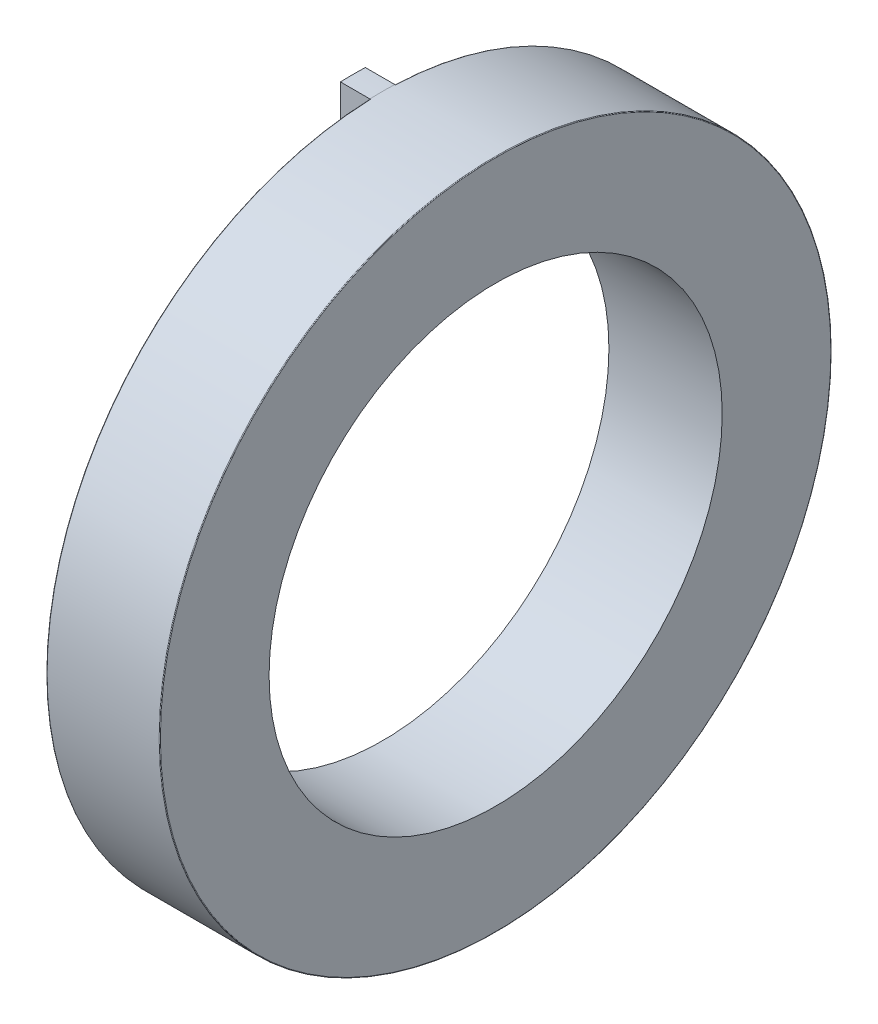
ISO-10303-21;
HEADER;
FILE_DESCRIPTION(('STEP AP214'),'2;1');
FILE_NAME('part.step','',(''),(''),'','','');
FILE_SCHEMA(('AUTOMOTIVE_DESIGN { 1 0 10303 214 1 1 1 1 }'));
ENDSEC;
DATA;
#1=APPLICATION_CONTEXT('core data for automotive mechanical design processes');
#2=APPLICATION_PROTOCOL_DEFINITION('international standard','automotive_design',2000,#1);
#3=PRODUCT_CONTEXT('',#1,'mechanical');
#4=PRODUCT('Part','Part','',(#3));
#5=PRODUCT_RELATED_PRODUCT_CATEGORY('part','',(#4));
#6=PRODUCT_DEFINITION_FORMATION('','',#4);
#7=PRODUCT_DEFINITION_CONTEXT('part definition',#1,'design');
#8=PRODUCT_DEFINITION('design','',#6,#7);
#9=PRODUCT_DEFINITION_SHAPE('','',#8);
#10=(LENGTH_UNIT() NAMED_UNIT(*) SI_UNIT(.MILLI.,.METRE.));
#11=(NAMED_UNIT(*) PLANE_ANGLE_UNIT() SI_UNIT($,.RADIAN.));
#12=(NAMED_UNIT(*) SI_UNIT($,.STERADIAN.) SOLID_ANGLE_UNIT());
#13=UNCERTAINTY_MEASURE_WITH_UNIT(LENGTH_MEASURE(1.E-05),#10,'distance_accuracy_value','');
#14=(GEOMETRIC_REPRESENTATION_CONTEXT(3) GLOBAL_UNCERTAINTY_ASSIGNED_CONTEXT((#13)) GLOBAL_UNIT_ASSIGNED_CONTEXT((#10,
#11,#12)) REPRESENTATION_CONTEXT('',''));
#15=CARTESIAN_POINT('',(0.,0.,0.));
#16=DIRECTION('',(0.,0.,1.));
#17=DIRECTION('',(1.,0.,0.));
#18=AXIS2_PLACEMENT_3D('',#15,#16,#17);
#19=CARTESIAN_POINT('',(0.,-33.9211770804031,0.));
#20=DIRECTION('',(0.,1.,0.));
#21=DIRECTION('',(0.,0.,1.));
#22=AXIS2_PLACEMENT_3D('',#19,#20,#21);
#23=PLANE('',#22);
#24=DIRECTION('',(0.,0.,-1.));
#25=VECTOR('',#24,1.);
#26=CARTESIAN_POINT('',(0.,-33.9211770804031,0.));
#27=LINE('',#26,#25);
#28=CARTESIAN_POINT('',(0.,-33.9211770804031,1.397));
#29=VERTEX_POINT('',#28);
#30=CARTESIAN_POINT('',(0.,-33.9211770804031,-1.397));
#31=VERTEX_POINT('',#30);
#32=EDGE_CURVE('E177',#29,#31,#27,.T.);
#33=ORIENTED_EDGE('',*,*,#32,.T.);
#34=DIRECTION('',(-1.,0.,0.));
#35=VECTOR('',#34,1.);
#36=CARTESIAN_POINT('',(0.,-33.9211770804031,-1.397));
#37=LINE('',#36,#35);
#38=CARTESIAN_POINT('',(-3.302,-33.9211770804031,-1.397));
#39=VERTEX_POINT('',#38);
#40=EDGE_CURVE('E149',#39,#31,#37,.F.);
#41=ORIENTED_EDGE('',*,*,#40,.F.);
#42=DIRECTION('',(0.,0.,-1.));
#43=VECTOR('',#42,1.);
#44=CARTESIAN_POINT('',(-3.302,-33.9211770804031,0.));
#45=LINE('',#44,#43);
#46=CARTESIAN_POINT('',(-3.302,-33.9211770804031,1.397));
#47=VERTEX_POINT('',#46);
#48=EDGE_CURVE('E150',#39,#47,#45,.F.);
#49=ORIENTED_EDGE('',*,*,#48,.T.);
#50=DIRECTION('',(1.,0.,0.));
#51=VECTOR('',#50,1.);
#52=CARTESIAN_POINT('',(0.,-33.9211770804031,1.397));
#53=LINE('',#52,#51);
#54=EDGE_CURVE('E115',#29,#47,#53,.F.);
#55=ORIENTED_EDGE('',*,*,#54,.F.);
#56=EDGE_LOOP('',(#33,#41,#49,#55));
#57=FACE_BOUND('',#56,.T.);
#58=ADVANCED_FACE('F17',(#57),#23,.T.);
#59=CARTESIAN_POINT('',(0.,33.9211770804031,0.));
#60=DIRECTION('',(0.,-1.,0.));
#61=DIRECTION('',(0.,0.,-1.));
#62=AXIS2_PLACEMENT_3D('',#59,#60,#61);
#63=PLANE('',#62);
#64=DIRECTION('',(0.,0.,-1.));
#65=VECTOR('',#64,1.);
#66=CARTESIAN_POINT('',(0.,33.9211770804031,0.));
#67=LINE('',#66,#65);
#68=CARTESIAN_POINT('',(0.,33.9211770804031,-1.397));
#69=VERTEX_POINT('',#68);
#70=CARTESIAN_POINT('',(0.,33.9211770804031,1.397));
#71=VERTEX_POINT('',#70);
#72=EDGE_CURVE('E160',#69,#71,#67,.F.);
#73=ORIENTED_EDGE('',*,*,#72,.T.);
#74=DIRECTION('',(1.,0.,0.));
#75=VECTOR('',#74,1.);
#76=CARTESIAN_POINT('',(0.,33.9211770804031,1.397));
#77=LINE('',#76,#75);
#78=CARTESIAN_POINT('',(-3.302,33.9211770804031,1.397));
#79=VERTEX_POINT('',#78);
#80=EDGE_CURVE('E153',#79,#71,#77,.T.);
#81=ORIENTED_EDGE('',*,*,#80,.F.);
#82=DIRECTION('',(0.,0.,-1.));
#83=VECTOR('',#82,1.);
#84=CARTESIAN_POINT('',(-3.302,33.9211770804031,0.));
#85=LINE('',#84,#83);
#86=CARTESIAN_POINT('',(-3.302,33.9211770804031,-1.397));
#87=VERTEX_POINT('',#86);
#88=EDGE_CURVE('E184',#79,#87,#85,.T.);
#89=ORIENTED_EDGE('',*,*,#88,.T.);
#90=DIRECTION('',(-1.,0.,0.));
#91=VECTOR('',#90,1.);
#92=CARTESIAN_POINT('',(0.,33.9211770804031,-1.397));
#93=LINE('',#92,#91);
#94=EDGE_CURVE('E166',#69,#87,#93,.T.);
#95=ORIENTED_EDGE('',*,*,#94,.F.);
#96=EDGE_LOOP('',(#73,#81,#89,#95));
#97=FACE_BOUND('',#96,.T.);
#98=ADVANCED_FACE('F413',(#97),#63,.T.);
#99=CARTESIAN_POINT('',(0.,0.,0.));
#100=DIRECTION('',(1.,0.,0.));
#101=DIRECTION('',(0.,0.,-1.));
#102=AXIS2_PLACEMENT_3D('',#99,#100,#101);
#103=CYLINDRICAL_SURFACE('',#102,25.4);
#104=CARTESIAN_POINT('',(0.,0.,0.));
#105=DIRECTION('',(1.,0.,0.));
#106=DIRECTION('',(0.,0.,-1.));
#107=AXIS2_PLACEMENT_3D('',#104,#105,#106);
#108=CIRCLE('',#107,25.4);
#109=CARTESIAN_POINT('',(0.,0.,-25.4));
#110=VERTEX_POINT('',#109);
#111=EDGE_CURVE('E359',#110,#110,#108,.F.);
#112=ORIENTED_EDGE('',*,*,#111,.T.);
#113=EDGE_LOOP('',(#112));
#114=FACE_BOUND('',#113,.T.);
#115=CARTESIAN_POINT('',(12.7,0.,0.));
#116=DIRECTION('',(1.,0.,0.));
#117=DIRECTION('',(0.,0.,-1.));
#118=AXIS2_PLACEMENT_3D('',#115,#116,#117);
#119=CIRCLE('',#118,25.4);
#120=CARTESIAN_POINT('',(12.7,0.,-25.4));
#121=VERTEX_POINT('',#120);
#122=EDGE_CURVE('E431',#121,#121,#119,.F.);
#123=ORIENTED_EDGE('',*,*,#122,.F.);
#124=EDGE_LOOP('',(#123));
#125=FACE_BOUND('',#124,.T.);
#126=ADVANCED_FACE('F410',(#114,#125),#103,.F.);
#127=CARTESIAN_POINT('',(-3.302,-35.7788015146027,0.));
#128=DIRECTION('',(1.,0.,0.));
#129=DIRECTION('',(0.,0.,-1.));
#130=AXIS2_PLACEMENT_3D('',#127,#128,#129);
#131=PLANE('',#130);
#132=DIRECTION('',(0.,1.,0.));
#133=VECTOR('',#132,1.);
#134=CARTESIAN_POINT('',(-3.302,-35.7753770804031,-1.397));
#135=LINE('',#134,#133);
#136=CARTESIAN_POINT('',(-3.302,-37.6295770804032,-1.39700000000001));
#137=VERTEX_POINT('',#136);
#138=EDGE_CURVE('E146',#137,#39,#135,.T.);
#139=ORIENTED_EDGE('',*,*,#138,.F.);
#140=CARTESIAN_POINT('',(-3.302,0.09803531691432,0.));
#141=DIRECTION('',(-1.,0.,0.));
#142=DIRECTION('',(0.,0.,1.));
#143=AXIS2_PLACEMENT_3D('',#140,#141,#142);
#144=CIRCLE('',#143,37.7534680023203);
#145=CARTESIAN_POINT('',(-3.302,-37.6295770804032,1.39700000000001));
#146=VERTEX_POINT('',#145);
#147=EDGE_CURVE('E207',#146,#137,#144,.F.);
#148=ORIENTED_EDGE('',*,*,#147,.F.);
#149=DIRECTION('',(0.,1.,0.));
#150=VECTOR('',#149,1.);
#151=CARTESIAN_POINT('',(-3.302,-35.7753770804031,1.397));
#152=LINE('',#151,#150);
#153=EDGE_CURVE('E130',#47,#146,#152,.F.);
#154=ORIENTED_EDGE('',*,*,#153,.F.);
#155=ORIENTED_EDGE('',*,*,#48,.F.);
#156=EDGE_LOOP('',(#139,#148,#154,#155));
#157=FACE_BOUND('',#156,.T.);
#158=ADVANCED_FACE('F406',(#157),#131,.F.);
#159=CARTESIAN_POINT('',(0.,-35.7753770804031,-1.397));
#160=DIRECTION('',(0.,0.,-1.));
#161=DIRECTION('',(-1.,0.,0.));
#162=AXIS2_PLACEMENT_3D('',#159,#160,#161);
#163=PLANE('',#162);
#164=DIRECTION('',(-1.,0.,0.));
#165=VECTOR('',#164,1.);
#166=CARTESIAN_POINT('',(0.,-37.6295770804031,-1.397));
#167=LINE('',#166,#165);
#168=CARTESIAN_POINT('',(0.0762,-37.6295770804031,-1.397));
#169=VERTEX_POINT('',#168);
#170=CARTESIAN_POINT('',(0.,-37.6295770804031,-1.39700000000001));
#171=VERTEX_POINT('',#170);
#172=EDGE_CURVE('E132',#169,#171,#167,.T.);
#173=ORIENTED_EDGE('',*,*,#172,.T.);
#174=DIRECTION('',(-1.,0.,0.));
#175=VECTOR('',#174,1.);
#176=CARTESIAN_POINT('',(0.,-37.6295770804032,-1.39700000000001));
#177=LINE('',#176,#175);
#178=EDGE_CURVE('E430',#137,#171,#177,.F.);
#179=ORIENTED_EDGE('',*,*,#178,.F.);
#180=ORIENTED_EDGE('',*,*,#138,.T.);
#181=ORIENTED_EDGE('',*,*,#40,.T.);
#182=DIRECTION('',(0.,1.,0.));
#183=VECTOR('',#182,1.);
#184=CARTESIAN_POINT('',(0.,0.,-1.397));
#185=LINE('',#184,#183);
#186=CARTESIAN_POINT('',(0.,-37.5533244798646,-1.39699999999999));
#187=VERTEX_POINT('',#186);
#188=EDGE_CURVE('E179',#31,#187,#185,.F.);
#189=ORIENTED_EDGE('',*,*,#188,.T.);
#190=CARTESIAN_POINT('',(0.,-37.5533244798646,-1.397));
#191=CARTESIAN_POINT('',(2.54472918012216E-07,-37.5576208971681,-1.39700000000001));
#192=CARTESIAN_POINT('',(0.00036384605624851,-37.5619096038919,-1.397));
#193=CARTESIAN_POINT('',(0.00180259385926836,-37.5703624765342,-1.397));
#194=CARTESIAN_POINT('',(0.00287720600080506,-37.5745267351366,-1.39699999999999));
#195=CARTESIAN_POINT('',(0.00713679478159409,-37.5866537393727,-1.39699999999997));
#196=CARTESIAN_POINT('',(0.0113577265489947,-37.5942791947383,-1.39699999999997));
#197=CARTESIAN_POINT('',(0.0220755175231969,-37.6076861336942,-1.39699999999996));
#198=CARTESIAN_POINT('',(0.0285716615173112,-37.613468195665,-1.39699999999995));
#199=CARTESIAN_POINT('',(0.0431201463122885,-37.6225447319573,-1.39699999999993));
#200=CARTESIAN_POINT('',(0.0511714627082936,-37.6258408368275,-1.39699999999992));
#201=CARTESIAN_POINT('',(0.0649978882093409,-37.6289659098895,-1.39699999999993));
#202=CARTESIAN_POINT('',(0.0706021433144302,-37.6295979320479,-1.39699999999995));
#203=CARTESIAN_POINT('',(0.0761999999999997,-37.6295770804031,-1.39699999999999));
#204=B_SPLINE_CURVE_WITH_KNOTS('',3,(#190,#191,#192,#193,#194,#195,#196,#197,#198,#199,#200,
#201,#202,#203),.UNSPECIFIED.,.F.,.F.,(4,2,2,2,2,2,4),(0.,0.0128589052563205,0.0257079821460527,
0.0513248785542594,0.0769337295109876,0.102525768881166,0.119305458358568),.UNSPECIFIED.);
#205=EDGE_CURVE('E143',#187,#169,#204,.T.);
#206=ORIENTED_EDGE('',*,*,#205,.T.);
#207=EDGE_LOOP('',(#173,#179,#180,#181,#189,#206));
#208=FACE_BOUND('',#207,.T.);
#209=ADVANCED_FACE('F402',(#208),#163,.T.);
#210=CARTESIAN_POINT('',(0.,-35.7753770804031,1.397));
#211=DIRECTION('',(0.,0.,1.));
#212=DIRECTION('',(1.,0.,0.));
#213=AXIS2_PLACEMENT_3D('',#210,#211,#212);
#214=PLANE('',#213);
#215=DIRECTION('',(0.,1.,0.));
#216=VECTOR('',#215,1.);
#217=CARTESIAN_POINT('',(0.,0.,1.397));
#218=LINE('',#217,#216);
#219=CARTESIAN_POINT('',(0.,-37.5533244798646,1.397));
#220=VERTEX_POINT('',#219);
#221=EDGE_CURVE('E169',#220,#29,#218,.T.);
#222=ORIENTED_EDGE('',*,*,#221,.T.);
#223=ORIENTED_EDGE('',*,*,#54,.T.);
#224=ORIENTED_EDGE('',*,*,#153,.T.);
#225=DIRECTION('',(-1.,0.,0.));
#226=VECTOR('',#225,1.);
#227=CARTESIAN_POINT('',(0.,-37.6295770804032,1.39700000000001));
#228=LINE('',#227,#226);
#229=CARTESIAN_POINT('',(0.,-37.6295770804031,1.39700000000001));
#230=VERTEX_POINT('',#229);
#231=EDGE_CURVE('E128',#230,#146,#228,.T.);
#232=ORIENTED_EDGE('',*,*,#231,.F.);
#233=DIRECTION('',(1.,0.,0.));
#234=VECTOR('',#233,1.);
#235=CARTESIAN_POINT('',(0.,-37.6295770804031,1.397));
#236=LINE('',#235,#234);
#237=CARTESIAN_POINT('',(0.0762,-37.6295770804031,1.397));
#238=VERTEX_POINT('',#237);
#239=EDGE_CURVE('E116',#230,#238,#236,.T.);
#240=ORIENTED_EDGE('',*,*,#239,.T.);
#241=CARTESIAN_POINT('',(0.0762,-37.6295770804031,1.397));
#242=CARTESIAN_POINT('',(0.0719108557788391,-37.629576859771,1.39700000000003));
#243=CARTESIAN_POINT('',(0.0676294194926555,-37.6292137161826,1.39700000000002));
#244=CARTESIAN_POINT('',(0.059191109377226,-37.6277769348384,1.39699999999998));
#245=CARTESIAN_POINT('',(0.0550341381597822,-37.6267038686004,1.39699999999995));
#246=CARTESIAN_POINT('',(0.0429285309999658,-37.6224508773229,1.3969999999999));
#247=CARTESIAN_POINT('',(0.0353167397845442,-37.6182369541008,1.39699999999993));
#248=CARTESIAN_POINT('',(0.0219273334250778,-37.607536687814,1.39699999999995));
#249=CARTESIAN_POINT('',(0.0161502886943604,-37.6010496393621,1.39699999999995));
#250=CARTESIAN_POINT('',(0.00706900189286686,-37.5865137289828,1.39699999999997));
#251=CARTESIAN_POINT('',(0.00376638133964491,-37.5784638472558,1.39699999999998));
#252=CARTESIAN_POINT('',(0.000618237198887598,-37.5646020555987,1.39699999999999));
#253=CARTESIAN_POINT('',(-2.09974928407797E-05,-37.5589600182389,1.39699999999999));
#254=CARTESIAN_POINT('',(0.,-37.5533244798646,1.39699999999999));
#255=B_SPLINE_CURVE_WITH_KNOTS('',3,(#241,#242,#243,#244,#245,#246,#247,#248,#249,#250,#251,
#252,#253,#254),.UNSPECIFIED.,.F.,.F.,(4,2,2,2,2,2,4),(0.,0.012837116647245,0.0256639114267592,
0.0512363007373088,0.0768166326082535,0.102413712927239,0.119306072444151),.UNSPECIFIED.);
#256=EDGE_CURVE('E105',#238,#220,#255,.T.);
#257=ORIENTED_EDGE('',*,*,#256,.T.);
#258=EDGE_LOOP('',(#222,#223,#224,#232,#240,#257));
#259=FACE_BOUND('',#258,.T.);
#260=ADVANCED_FACE('F125',(#259),#214,.T.);
#261=CARTESIAN_POINT('',(-3.302,35.7788015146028,0.));
#262=DIRECTION('',(1.,0.,0.));
#263=DIRECTION('',(0.,0.,-1.));
#264=AXIS2_PLACEMENT_3D('',#261,#262,#263);
#265=PLANE('',#264);
#266=DIRECTION('',(0.,1.,0.));
#267=VECTOR('',#266,1.);
#268=CARTESIAN_POINT('',(-3.302,35.7753770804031,-1.397));
#269=LINE('',#268,#267);
#270=CARTESIAN_POINT('',(-3.302,37.6295770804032,-1.397));
#271=VERTEX_POINT('',#270);
#272=EDGE_CURVE('E290',#87,#271,#269,.T.);
#273=ORIENTED_EDGE('',*,*,#272,.F.);
#274=ORIENTED_EDGE('',*,*,#88,.F.);
#275=DIRECTION('',(0.,1.,0.));
#276=VECTOR('',#275,1.);
#277=CARTESIAN_POINT('',(-3.302,35.7753770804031,1.397));
#278=LINE('',#277,#276);
#279=CARTESIAN_POINT('',(-3.302,37.6295770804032,1.397));
#280=VERTEX_POINT('',#279);
#281=EDGE_CURVE('E157',#280,#79,#278,.F.);
#282=ORIENTED_EDGE('',*,*,#281,.F.);
#283=CARTESIAN_POINT('',(-3.302,-0.09803531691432,0.));
#284=DIRECTION('',(-1.,0.,0.));
#285=DIRECTION('',(0.,0.,1.));
#286=AXIS2_PLACEMENT_3D('',#283,#284,#285);
#287=CIRCLE('',#286,37.7534680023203);
#288=EDGE_CURVE('E193',#271,#280,#287,.F.);
#289=ORIENTED_EDGE('',*,*,#288,.F.);
#290=EDGE_LOOP('',(#273,#274,#282,#289));
#291=FACE_BOUND('',#290,.T.);
#292=ADVANCED_FACE('F401',(#291),#265,.F.);
#293=CARTESIAN_POINT('',(0.,35.7753770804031,1.397));
#294=DIRECTION('',(0.,0.,1.));
#295=DIRECTION('',(1.,0.,0.));
#296=AXIS2_PLACEMENT_3D('',#293,#294,#295);
#297=PLANE('',#296);
#298=DIRECTION('',(1.,0.,0.));
#299=VECTOR('',#298,1.);
#300=CARTESIAN_POINT('',(0.,37.6295770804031,1.397));
#301=LINE('',#300,#299);
#302=CARTESIAN_POINT('',(0.0762,37.6295770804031,1.397));
#303=VERTEX_POINT('',#302);
#304=CARTESIAN_POINT('',(0.,37.6295770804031,1.397));
#305=VERTEX_POINT('',#304);
#306=EDGE_CURVE('E40',#303,#305,#301,.F.);
#307=ORIENTED_EDGE('',*,*,#306,.T.);
#308=DIRECTION('',(-1.,0.,0.));
#309=VECTOR('',#308,1.);
#310=CARTESIAN_POINT('',(0.,37.6295770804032,1.397));
#311=LINE('',#310,#309);
#312=EDGE_CURVE('E196',#280,#305,#311,.F.);
#313=ORIENTED_EDGE('',*,*,#312,.F.);
#314=ORIENTED_EDGE('',*,*,#281,.T.);
#315=ORIENTED_EDGE('',*,*,#80,.T.);
#316=DIRECTION('',(0.,1.,0.));
#317=VECTOR('',#316,1.);
#318=CARTESIAN_POINT('',(0.,0.,1.397));
#319=LINE('',#318,#317);
#320=CARTESIAN_POINT('',(0.,37.5533244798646,1.397));
#321=VERTEX_POINT('',#320);
#322=EDGE_CURVE('E162',#71,#321,#319,.T.);
#323=ORIENTED_EDGE('',*,*,#322,.T.);
#324=CARTESIAN_POINT('',(0.,37.5533244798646,1.397));
#325=CARTESIAN_POINT('',(2.54472916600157E-07,37.5576208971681,1.39700000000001));
#326=CARTESIAN_POINT('',(0.000363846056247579,37.5619096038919,1.39700000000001));
#327=CARTESIAN_POINT('',(0.00180259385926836,37.5703624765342,1.39699999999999));
#328=CARTESIAN_POINT('',(0.00287720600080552,37.5745267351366,1.39699999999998));
#329=CARTESIAN_POINT('',(0.00713679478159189,37.5866537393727,1.39699999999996));
#330=CARTESIAN_POINT('',(0.0113577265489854,37.5942791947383,1.39699999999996));
#331=CARTESIAN_POINT('',(0.0220755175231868,37.6076861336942,1.39699999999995));
#332=CARTESIAN_POINT('',(0.0285716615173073,37.613468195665,1.39699999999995));
#333=CARTESIAN_POINT('',(0.0431201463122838,37.6225447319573,1.39699999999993));
#334=CARTESIAN_POINT('',(0.0511714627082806,37.6258408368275,1.39699999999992));
#335=CARTESIAN_POINT('',(0.0649978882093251,37.6289659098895,1.39699999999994));
#336=CARTESIAN_POINT('',(0.0706021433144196,37.6295979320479,1.39699999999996));
#337=CARTESIAN_POINT('',(0.0761999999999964,37.6295770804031,1.397));
#338=B_SPLINE_CURVE_WITH_KNOTS('',3,(#324,#325,#326,#327,#328,#329,#330,#331,#332,#333,#334,
#335,#336,#337),.UNSPECIFIED.,.F.,.F.,(4,2,2,2,2,2,4),(0.,0.0128589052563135,0.0257079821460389,
0.0513248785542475,0.0769337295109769,0.102525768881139,0.119305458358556),.UNSPECIFIED.);
#339=EDGE_CURVE('E156',#321,#303,#338,.T.);
#340=ORIENTED_EDGE('',*,*,#339,.T.);
#341=EDGE_LOOP('',(#307,#313,#314,#315,#323,#340));
#342=FACE_BOUND('',#341,.T.);
#343=ADVANCED_FACE('F423',(#342),#297,.T.);
#344=CARTESIAN_POINT('',(0.,35.7753770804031,-1.397));
#345=DIRECTION('',(0.,0.,-1.));
#346=DIRECTION('',(-1.,0.,0.));
#347=AXIS2_PLACEMENT_3D('',#344,#345,#346);
#348=PLANE('',#347);
#349=DIRECTION('',(0.,1.,0.));
#350=VECTOR('',#349,1.);
#351=CARTESIAN_POINT('',(0.,0.,-1.397));
#352=LINE('',#351,#350);
#353=CARTESIAN_POINT('',(0.,37.5533244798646,-1.39700000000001));
#354=VERTEX_POINT('',#353);
#355=EDGE_CURVE('E163',#354,#69,#352,.F.);
#356=ORIENTED_EDGE('',*,*,#355,.T.);
#357=ORIENTED_EDGE('',*,*,#94,.T.);
#358=ORIENTED_EDGE('',*,*,#272,.T.);
#359=DIRECTION('',(-1.,0.,0.));
#360=VECTOR('',#359,1.);
#361=CARTESIAN_POINT('',(0.,37.6295770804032,-1.397));
#362=LINE('',#361,#360);
#363=CARTESIAN_POINT('',(0.,37.6295770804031,-1.397));
#364=VERTEX_POINT('',#363);
#365=EDGE_CURVE('E278',#364,#271,#362,.T.);
#366=ORIENTED_EDGE('',*,*,#365,.F.);
#367=DIRECTION('',(-1.,0.,0.));
#368=VECTOR('',#367,1.);
#369=CARTESIAN_POINT('',(0.,37.6295770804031,-1.397));
#370=LINE('',#369,#368);
#371=CARTESIAN_POINT('',(0.0762,37.6295770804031,-1.39699999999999));
#372=VERTEX_POINT('',#371);
#373=EDGE_CURVE('E170',#364,#372,#370,.F.);
#374=ORIENTED_EDGE('',*,*,#373,.T.);
#375=CARTESIAN_POINT('',(0.,37.5533244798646,-1.39700000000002));
#376=CARTESIAN_POINT('',(2.54472917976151E-07,37.5576208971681,-1.39700000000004));
#377=CARTESIAN_POINT('',(0.000363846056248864,37.5619096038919,-1.39700000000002));
#378=CARTESIAN_POINT('',(0.00180259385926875,37.5703624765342,-1.39699999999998));
#379=CARTESIAN_POINT('',(0.00287720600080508,37.5745267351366,-1.39699999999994));
#380=CARTESIAN_POINT('',(0.00713679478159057,37.5866537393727,-1.39699999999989));
#381=CARTESIAN_POINT('',(0.0113577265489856,37.5942791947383,-1.39699999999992));
#382=CARTESIAN_POINT('',(0.0220755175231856,37.6076861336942,-1.39699999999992));
#383=CARTESIAN_POINT('',(0.0285716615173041,37.613468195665,-1.3969999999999));
#384=CARTESIAN_POINT('',(0.0431201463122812,37.6225447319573,-1.39699999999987));
#385=CARTESIAN_POINT('',(0.0511714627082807,37.6258408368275,-1.39699999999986));
#386=CARTESIAN_POINT('',(0.0649978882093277,37.6289659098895,-1.3969999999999));
#387=CARTESIAN_POINT('',(0.0706021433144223,37.6295979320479,-1.39699999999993));
#388=CARTESIAN_POINT('',(0.0761999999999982,37.6295770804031,-1.39699999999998));
#389=B_SPLINE_CURVE_WITH_KNOTS('',3,(#375,#376,#377,#378,#379,#380,#381,#382,#383,#384,#385,
#386,#387,#388),.UNSPECIFIED.,.F.,.F.,(4,2,2,2,2,2,4),(0.,0.0128589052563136,0.0257079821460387,
0.0513248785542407,0.0769337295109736,0.10252576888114,0.119305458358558),.UNSPECIFIED.);
#390=EDGE_CURVE('E198',#354,#372,#389,.T.);
#391=ORIENTED_EDGE('',*,*,#390,.F.);
#392=EDGE_LOOP('',(#356,#357,#358,#366,#374,#391));
#393=FACE_BOUND('',#392,.T.);
#394=ADVANCED_FACE('F209',(#393),#348,.T.);
#395=CARTESIAN_POINT('',(0.,0.,0.));
#396=DIRECTION('',(1.,0.,0.));
#397=DIRECTION('',(0.,0.,-1.));
#398=AXIS2_PLACEMENT_3D('',#395,#396,#397);
#399=PLANE('',#398);
#400=ORIENTED_EDGE('',*,*,#111,.F.);
#401=EDGE_LOOP('',(#400));
#402=FACE_BOUND('',#401,.T.);
#403=ORIENTED_EDGE('',*,*,#322,.F.);
#404=ORIENTED_EDGE('',*,*,#72,.F.);
#405=ORIENTED_EDGE('',*,*,#355,.F.);
#406=CARTESIAN_POINT('',(0.,0.,0.));
#407=DIRECTION('',(1.,0.,0.));
#408=DIRECTION('',(0.,-0.999308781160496,-0.0371747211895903));
#409=AXIS2_PLACEMENT_3D('',#406,#407,#408);
#410=CIRCLE('',#409,37.5793);
#411=EDGE_CURVE('E197',#187,#354,#410,.T.);
#412=ORIENTED_EDGE('',*,*,#411,.F.);
#413=ORIENTED_EDGE('',*,*,#188,.F.);
#414=ORIENTED_EDGE('',*,*,#32,.F.);
#415=ORIENTED_EDGE('',*,*,#221,.F.);
#416=CARTESIAN_POINT('',(0.,0.,0.));
#417=DIRECTION('',(1.,0.,0.));
#418=DIRECTION('',(0.,0.999308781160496,0.0371747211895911));
#419=AXIS2_PLACEMENT_3D('',#416,#417,#418);
#420=CIRCLE('',#419,37.5793);
#421=EDGE_CURVE('E109',#321,#220,#420,.T.);
#422=ORIENTED_EDGE('',*,*,#421,.F.);
#423=EDGE_LOOP('',(#403,#404,#405,#412,#413,#414,#415,#422));
#424=FACE_BOUND('',#423,.T.);
#425=ADVANCED_FACE('F327',(#402,#424),#399,.F.);
#426=CARTESIAN_POINT('',(12.7,0.,0.));
#427=DIRECTION('',(1.,0.,0.));
#428=DIRECTION('',(0.,0.,-1.));
#429=AXIS2_PLACEMENT_3D('',#426,#427,#428);
#430=PLANE('',#429);
#431=CARTESIAN_POINT('',(12.7,0.,0.));
#432=DIRECTION('',(-1.,0.,0.));
#433=DIRECTION('',(0.,0.,-1.));
#434=AXIS2_PLACEMENT_3D('',#431,#432,#433);
#435=CIRCLE('',#434,37.5793);
#436=CARTESIAN_POINT('',(12.7,0.,-37.5793));
#437=VERTEX_POINT('',#436);
#438=EDGE_CURVE('E281',#437,#437,#435,.T.);
#439=ORIENTED_EDGE('',*,*,#438,.F.);
#440=EDGE_LOOP('',(#439));
#441=FACE_BOUND('',#440,.T.);
#442=ORIENTED_EDGE('',*,*,#122,.T.);
#443=EDGE_LOOP('',(#442));
#444=FACE_BOUND('',#443,.T.);
#445=ADVANCED_FACE('F345',(#441,#444),#430,.T.);
#446=CARTESIAN_POINT('',(0.,0.09803531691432,0.));
#447=DIRECTION('',(-1.,0.,0.));
#448=DIRECTION('',(0.,0.,1.));
#449=AXIS2_PLACEMENT_3D('',#446,#447,#448);
#450=CYLINDRICAL_SURFACE('',#449,37.7534680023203);
#451=CARTESIAN_POINT('',(0.,0.,0.));
#452=DIRECTION('',(1.,0.,0.));
#453=DIRECTION('',(0.,-0.999311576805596,0.0370994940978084));
#454=AXIS2_PLACEMENT_3D('',#451,#452,#453);
#455=CIRCLE('',#454,37.6555);
#456=EDGE_CURVE('E235',#230,#171,#455,.T.);
#457=ORIENTED_EDGE('',*,*,#456,.F.);
#458=ORIENTED_EDGE('',*,*,#231,.T.);
#459=ORIENTED_EDGE('',*,*,#147,.T.);
#460=ORIENTED_EDGE('',*,*,#178,.T.);
#461=EDGE_LOOP('',(#457,#458,#459,#460));
#462=FACE_BOUND('',#461,.T.);
#463=ADVANCED_FACE('F220',(#462),#450,.T.);
#464=CARTESIAN_POINT('',(0.0762,0.,0.));
#465=DIRECTION('',(1.,0.,0.));
#466=DIRECTION('',(0.,1.,0.));
#467=AXIS2_PLACEMENT_3D('',#464,#465,#466);
#468=TOROIDAL_SURFACE('',#467,37.5793,0.0762);
#469=ORIENTED_EDGE('',*,*,#205,.F.);
#470=ORIENTED_EDGE('',*,*,#411,.T.);
#471=ORIENTED_EDGE('',*,*,#390,.T.);
#472=CARTESIAN_POINT('',(0.0762,0.,0.));
#473=DIRECTION('',(1.,0.,0.));
#474=DIRECTION('',(0.,0.,-1.));
#475=AXIS2_PLACEMENT_3D('',#472,#473,#474);
#476=CIRCLE('',#475,37.6555);
#477=EDGE_CURVE('E136',#169,#372,#476,.T.);
#478=ORIENTED_EDGE('',*,*,#477,.F.);
#479=EDGE_LOOP('',(#469,#470,#471,#478));
#480=FACE_BOUND('',#479,.T.);
#481=ADVANCED_FACE('F213',(#480),#468,.T.);
#482=CARTESIAN_POINT('',(0.,-0.09803531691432,0.));
#483=DIRECTION('',(-1.,0.,0.));
#484=DIRECTION('',(0.,0.,1.));
#485=AXIS2_PLACEMENT_3D('',#482,#483,#484);
#486=CYLINDRICAL_SURFACE('',#485,37.7534680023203);
#487=CARTESIAN_POINT('',(0.,0.,0.));
#488=DIRECTION('',(1.,0.,0.));
#489=DIRECTION('',(0.,0.999311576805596,-0.0370994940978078));
#490=AXIS2_PLACEMENT_3D('',#487,#488,#489);
#491=CIRCLE('',#490,37.6555);
#492=EDGE_CURVE('E123',#364,#305,#491,.T.);
#493=ORIENTED_EDGE('',*,*,#492,.F.);
#494=ORIENTED_EDGE('',*,*,#365,.T.);
#495=ORIENTED_EDGE('',*,*,#288,.T.);
#496=ORIENTED_EDGE('',*,*,#312,.T.);
#497=EDGE_LOOP('',(#493,#494,#495,#496));
#498=FACE_BOUND('',#497,.T.);
#499=ADVANCED_FACE('F219',(#498),#486,.T.);
#500=CARTESIAN_POINT('',(0.0762,0.,0.));
#501=DIRECTION('',(1.,0.,0.));
#502=DIRECTION('',(0.,1.,0.));
#503=AXIS2_PLACEMENT_3D('',#500,#501,#502);
#504=TOROIDAL_SURFACE('',#503,37.5793,0.0762);
#505=ORIENTED_EDGE('',*,*,#339,.F.);
#506=ORIENTED_EDGE('',*,*,#421,.T.);
#507=ORIENTED_EDGE('',*,*,#256,.F.);
#508=CARTESIAN_POINT('',(0.0762,0.,0.));
#509=DIRECTION('',(1.,0.,0.));
#510=DIRECTION('',(0.,0.,-1.));
#511=AXIS2_PLACEMENT_3D('',#508,#509,#510);
#512=CIRCLE('',#511,37.6555);
#513=EDGE_CURVE('E31',#303,#238,#512,.T.);
#514=ORIENTED_EDGE('',*,*,#513,.F.);
#515=EDGE_LOOP('',(#505,#506,#507,#514));
#516=FACE_BOUND('',#515,.T.);
#517=ADVANCED_FACE('F107',(#516),#504,.T.);
#518=CARTESIAN_POINT('',(12.6238,0.,0.));
#519=DIRECTION('',(-1.,0.,0.));
#520=DIRECTION('',(0.,1.,0.));
#521=AXIS2_PLACEMENT_3D('',#518,#519,#520);
#522=TOROIDAL_SURFACE('',#521,37.5793,0.0762);
#523=CARTESIAN_POINT('',(12.6238,0.,0.));
#524=DIRECTION('',(1.,0.,0.));
#525=DIRECTION('',(0.,0.,-1.));
#526=AXIS2_PLACEMENT_3D('',#523,#524,#525);
#527=CIRCLE('',#526,37.6555);
#528=CARTESIAN_POINT('',(12.6238,0.,-37.6555));
#529=VERTEX_POINT('',#528);
#530=EDGE_CURVE('E11',#529,#529,#527,.F.);
#531=ORIENTED_EDGE('',*,*,#530,.F.);
#532=EDGE_LOOP('',(#531));
#533=FACE_BOUND('',#532,.T.);
#534=ORIENTED_EDGE('',*,*,#438,.T.);
#535=EDGE_LOOP('',(#534));
#536=FACE_BOUND('',#535,.T.);
#537=ADVANCED_FACE('F249',(#533,#536),#522,.T.);
#538=CARTESIAN_POINT('',(0.,0.,0.));
#539=DIRECTION('',(1.,0.,0.));
#540=DIRECTION('',(0.,0.,-1.));
#541=AXIS2_PLACEMENT_3D('',#538,#539,#540);
#542=CYLINDRICAL_SURFACE('',#541,37.6555);
#543=ORIENTED_EDGE('',*,*,#530,.T.);
#544=EDGE_LOOP('',(#543));
#545=FACE_BOUND('',#544,.T.);
#546=ORIENTED_EDGE('',*,*,#306,.F.);
#547=ORIENTED_EDGE('',*,*,#513,.T.);
#548=ORIENTED_EDGE('',*,*,#239,.F.);
#549=ORIENTED_EDGE('',*,*,#456,.T.);
#550=ORIENTED_EDGE('',*,*,#172,.F.);
#551=ORIENTED_EDGE('',*,*,#477,.T.);
#552=ORIENTED_EDGE('',*,*,#373,.F.);
#553=ORIENTED_EDGE('',*,*,#492,.T.);
#554=EDGE_LOOP('',(#546,#547,#548,#549,#550,#551,#552,#553));
#555=FACE_BOUND('',#554,.T.);
#556=ADVANCED_FACE('F119',(#545,#555),#542,.T.);
#557=CLOSED_SHELL('',(#58,#98,#126,#158,#209,#260,#292,#343,#394,#425,#445,#463,#481,#499,#517,
#537,#556));
#558=MANIFOLD_SOLID_BREP('B1',#557);
#559=ADVANCED_BREP_SHAPE_REPRESENTATION('',(#18,#558),#14);
#560=SHAPE_DEFINITION_REPRESENTATION(#9,#559);
ENDSEC;
END-ISO-10303-21;
